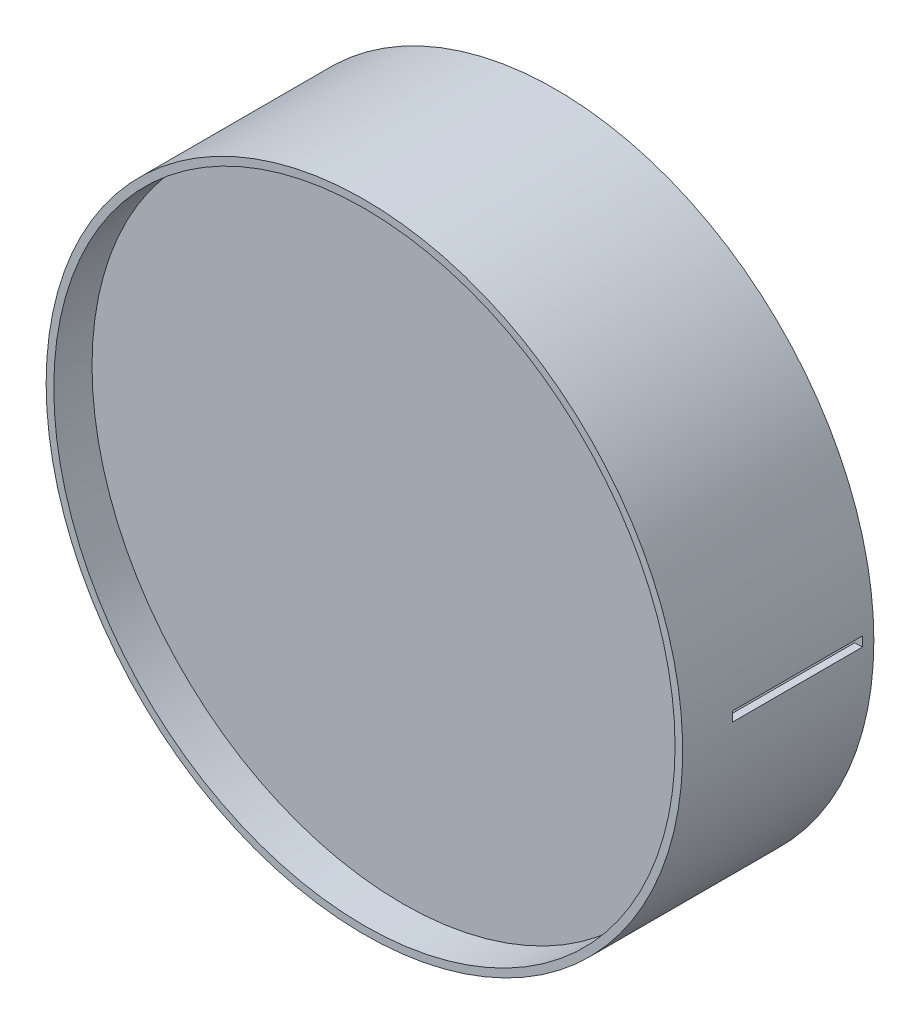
from build123d import *

# Parameters (mm, degrees)
SCHIZZO1_R                   = 99.9
SCHIZZO1_R_2                 = 97.5
ESTRUSIONE_SOTTILE1_DEPTH    = 48
SCHIZZO2_R                   = 99.9
ESTRUSIONE_ESTRUSIONE1_DEPTH = 3.6
ESTRUSIONE_ESTRUSIONE2_START = -3.6
SCHIZZO3_R                   = 99.9
ESTRUSIONE_ESTRUSIONE2_DEPTH = 3.6
ESTRUSIONE_SOTTILE2_START    = 12
SCHIZZO4_R                   = 99.9
SCHIZZO4_R_2                 = 97.5
ESTRUSIONE_SOTTILE2_DEPTH    = 12
ESTRUSIONE_ESTRUSIONE3_START = -1.8
SCHIZZO5_R                   = 32
ESTRUSIONE_ESTRUSIONE3_DEPTH = 1.8
TAGLIO_ESTRUSIONE2_START     = -3.6
SCHIZZO5_2_R                 = 32
TAGLIO_ESTRUSIONE2_DEPTH     = 1.8
TAGLIO_ESTRUSIONE1_DEPTH     = 40.8
CORPO_SPOSTA_COPIA1_ANGLE    = 180


with BuildPart() as part:
    # Schizzo1 → Estrusione-Sottile1 (new body)
    with BuildSketch(Plane.XY):
        Circle(SCHIZZO1_R)
        Circle(SCHIZZO1_R_2, mode=Mode.SUBTRACT)
    extrude(amount=ESTRUSIONE_SOTTILE1_DEPTH)

    # Schizzo2 → Estrusione-Estrusione1 (add)
    with BuildSketch(Plane(origin=(0, 0, 0), x_dir=(-1, 0, 0), z_dir=(0, 0, -1))):
        with Locations(Location((0, 0, 0), (0, 0, 180))):
            Circle(SCHIZZO2_R)
    extrude(amount=-ESTRUSIONE_ESTRUSIONE1_DEPTH)

    # Schizzo3 → Estrusione-Estrusione2 (add)
    with BuildSketch(Plane.XY.offset(48).offset(ESTRUSIONE_ESTRUSIONE2_START)):
        Circle(SCHIZZO3_R)
    extrude(amount=ESTRUSIONE_ESTRUSIONE2_DEPTH)

    # Schizzo4 → Estrusione-Sottile2 (add)
    with BuildSketch(Plane(origin=(0, 0, 0), x_dir=(-1, 0, 0), z_dir=(0, 0, -1)).offset(ESTRUSIONE_SOTTILE2_START)):
        Circle(SCHIZZO4_R)
        Circle(SCHIZZO4_R_2, mode=Mode.SUBTRACT)
    extrude(amount=-ESTRUSIONE_SOTTILE2_DEPTH)

    # Schizzo5_2 → Taglio-Estrusione2 (cut)
    with BuildSketch(Plane.XY.offset(48).offset(TAGLIO_ESTRUSIONE2_START)):
        Circle(SCHIZZO5_2_R)
    extrude(amount=TAGLIO_ESTRUSIONE2_DEPTH, mode=Mode.SUBTRACT)

    # Schizzo6 → Taglio-Estrusione1 (cut)
    with BuildSketch(Plane(origin=(0, 0, 44.4), x_dir=(-1, 0, 0), z_dir=(0, 0, -1))):
        Polygon((-559.049346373, -16.795843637), (-99.854944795, -3), (0, 0), (-99.9, 0), (-559.301593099, 0), (-1478.001177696, -13.797399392), (-1477.74893097, -30.593243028), align=None)
    extrude(amount=TAGLIO_ESTRUSIONE1_DEPTH, mode=Mode.SUBTRACT)


with BuildPart() as body_2:
    # Schizzo5 → Estrusione-Estrusione3 (new body)
    with BuildSketch(Plane.XY.offset(48).offset(ESTRUSIONE_ESTRUSIONE3_START)):
        Circle(SCHIZZO5_R)
    extrude(amount=-ESTRUSIONE_ESTRUSIONE3_DEPTH)


with BuildPart() as part_1:
    # Corpo-Sposta_copia1: moved
    add(part.part.rotate(Axis((0, 0, 31.65), (1, 0, 0)), CORPO_SPOSTA_COPIA1_ANGLE))


with BuildPart() as body_2_1:
    # Corpo-Sposta_copia1: moved
    add(body_2.part.rotate(Axis((0, 0, 31.65), (1, 0, 0)), CORPO_SPOSTA_COPIA1_ANGLE))


solid = Compound([part_1.part, body_2_1.part])
